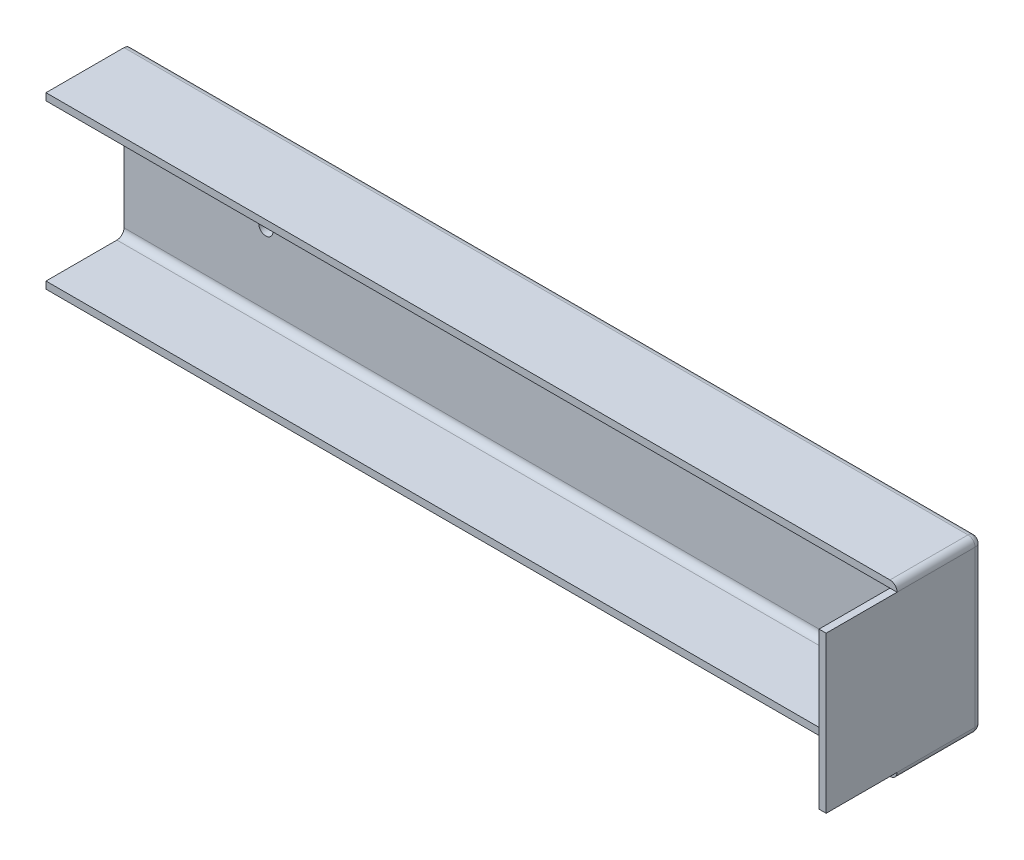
from build123d import *

# Parameters (mm, degrees)
ESQUISSE1_W             = 240
ESQUISSE1_H             = 48
BOSS_EXTRU_1_DEPTH      = 24
ESQUISSE2_W             = 240
ESQUISSE2_H             = 44
ENL_V_MAT_EXTRU_1_DEPTH = 22
CONG_1_R                = 2
CONG_2_R                = 2
ESQUISSE4_W             = 44
ESQUISSE4_H             = 44
BOSS_EXTRU_2_DEPTH      = 2
CONG_3_R                = 2
ESQUISSE5_R             = 2
ENL_V_MAT_EXTRU_2_DEPTH = 2


with BuildPart() as part:
    # Esquisse1 → Boss.-Extru.1 (new body)
    with BuildSketch(Plane.XY):
        Rectangle(ESQUISSE1_W, ESQUISSE1_H)
    extrude(amount=BOSS_EXTRU_1_DEPTH)

    # Esquisse2 → Enl_v. mat.-Extru.1 (cut)
    with BuildSketch(Plane.XY.offset(24)):
        Rectangle(ESQUISSE2_W, ESQUISSE2_H)
    extrude(amount=-ENL_V_MAT_EXTRU_1_DEPTH, mode=Mode.SUBTRACT)

    # Cong_1
    cong_1_edges = [part.edges().sort_by_distance(p)[0] for p in [
        (0, 24, 0),
    ]]
    fillet(cong_1_edges, radius=CONG_1_R)

    # Cong_2
    cong_2_edges = [part.edges().sort_by_distance(p)[0] for p in [
        (0, -22, 2),
        (0, 22, 2),
        (0, -24, 0),
    ]]
    fillet(cong_2_edges, radius=CONG_2_R)

    # Esquisse4 → Boss.-Extru.2 (add)
    with BuildSketch(Plane(origin=(120, 0, 0), x_dir=(0, 0, -1), z_dir=(1, 0, 0))):
        with Locations((-22, 0)):
            Rectangle(ESQUISSE4_W, ESQUISSE4_H)
    extrude(amount=-BOSS_EXTRU_2_DEPTH)

    # Cong_3
    cong_3_edges = [part.edges().sort_by_distance(p)[0] for p in [
        (120, -24, 13),
        (120, -23.414213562, 0.585786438),
        (120, 24, 13),
        (120, 23.414213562, 0.585786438),
        (120, 0, 0),
    ]]
    fillet(cong_3_edges, radius=CONG_3_R)

    # Esquisse5 → Enl_v. mat.-Extru.2 (cut)
    with BuildSketch(Plane.XY.offset(2)):
        with Locations((-80, 0)):
            Circle(ESQUISSE5_R)
    extrude(amount=-ENL_V_MAT_EXTRU_2_DEPTH, mode=Mode.SUBTRACT)


solid = part.part
